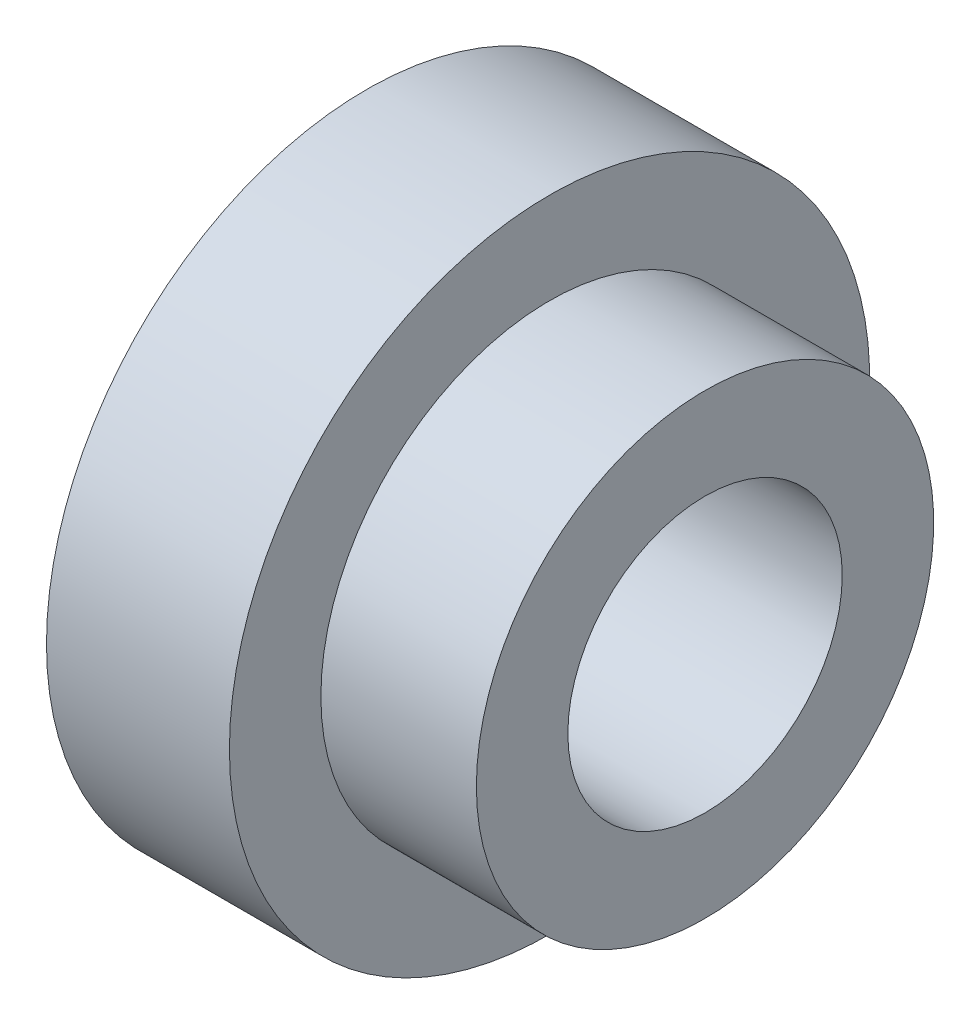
ISO-10303-21;
HEADER;
FILE_DESCRIPTION(('STEP AP214'),'2;1');
FILE_NAME('part.step','',(''),(''),'','','');
FILE_SCHEMA(('AUTOMOTIVE_DESIGN { 1 0 10303 214 1 1 1 1 }'));
ENDSEC;
DATA;
#1=APPLICATION_CONTEXT('core data for automotive mechanical design processes');
#2=APPLICATION_PROTOCOL_DEFINITION('international standard','automotive_design',2000,#1);
#3=PRODUCT_CONTEXT('',#1,'mechanical');
#4=PRODUCT('Part','Part','',(#3));
#5=PRODUCT_RELATED_PRODUCT_CATEGORY('part','',(#4));
#6=PRODUCT_DEFINITION_FORMATION('','',#4);
#7=PRODUCT_DEFINITION_CONTEXT('part definition',#1,'design');
#8=PRODUCT_DEFINITION('design','',#6,#7);
#9=PRODUCT_DEFINITION_SHAPE('','',#8);
#10=(LENGTH_UNIT() NAMED_UNIT(*) SI_UNIT(.MILLI.,.METRE.));
#11=(NAMED_UNIT(*) PLANE_ANGLE_UNIT() SI_UNIT($,.RADIAN.));
#12=(NAMED_UNIT(*) SI_UNIT($,.STERADIAN.) SOLID_ANGLE_UNIT());
#13=UNCERTAINTY_MEASURE_WITH_UNIT(LENGTH_MEASURE(1.E-05),#10,'distance_accuracy_value','');
#14=(GEOMETRIC_REPRESENTATION_CONTEXT(3) GLOBAL_UNCERTAINTY_ASSIGNED_CONTEXT((#13)) GLOBAL_UNIT_ASSIGNED_CONTEXT((#10,
#11,#12)) REPRESENTATION_CONTEXT('',''));
#15=CARTESIAN_POINT('',(0.,0.,0.));
#16=DIRECTION('',(0.,0.,1.));
#17=DIRECTION('',(1.,0.,0.));
#18=AXIS2_PLACEMENT_3D('',#15,#16,#17);
#19=CARTESIAN_POINT('',(0.,0.,-7.));
#20=DIRECTION('',(1.,0.,0.));
#21=DIRECTION('',(0.,0.,-1.));
#22=AXIS2_PLACEMENT_3D('',#19,#20,#21);
#23=PLANE('',#22);
#24=CARTESIAN_POINT('',(0.,0.,0.));
#25=DIRECTION('',(1.,0.,0.));
#26=DIRECTION('',(0.,0.,-1.));
#27=AXIS2_PLACEMENT_3D('',#24,#25,#26);
#28=CIRCLE('',#27,3.);
#29=CARTESIAN_POINT('',(0.,0.,-3.));
#30=VERTEX_POINT('',#29);
#31=EDGE_CURVE('E48',#30,#30,#28,.T.);
#32=ORIENTED_EDGE('',*,*,#31,.T.);
#33=EDGE_LOOP('',(#32));
#34=FACE_BOUND('',#33,.T.);
#35=CARTESIAN_POINT('',(0.,0.,0.));
#36=DIRECTION('',(-1.,0.,0.));
#37=DIRECTION('',(0.,0.,1.));
#38=AXIS2_PLACEMENT_3D('',#35,#36,#37);
#39=CIRCLE('',#38,7.);
#40=CARTESIAN_POINT('',(0.,0.,7.));
#41=VERTEX_POINT('',#40);
#42=EDGE_CURVE('E43',#41,#41,#39,.T.);
#43=ORIENTED_EDGE('',*,*,#42,.T.);
#44=EDGE_LOOP('',(#43));
#45=FACE_BOUND('',#44,.T.);
#46=ADVANCED_FACE('F29',(#34,#45),#23,.F.);
#47=CARTESIAN_POINT('',(7.40000000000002,0.,0.));
#48=DIRECTION('',(-1.,0.,0.));
#49=DIRECTION('',(0.,0.,1.));
#50=AXIS2_PLACEMENT_3D('',#47,#48,#49);
#51=PLANE('',#50);
#52=CARTESIAN_POINT('',(7.40000000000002,0.,0.));
#53=DIRECTION('',(1.,0.,0.));
#54=DIRECTION('',(0.,0.,-1.));
#55=AXIS2_PLACEMENT_3D('',#52,#53,#54);
#56=CIRCLE('',#55,3.);
#57=CARTESIAN_POINT('',(7.40000000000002,0.,-3.));
#58=VERTEX_POINT('',#57);
#59=EDGE_CURVE('E49',#58,#58,#56,.T.);
#60=ORIENTED_EDGE('',*,*,#59,.F.);
#61=EDGE_LOOP('',(#60));
#62=FACE_BOUND('',#61,.T.);
#63=CARTESIAN_POINT('',(7.40000000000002,0.,0.));
#64=DIRECTION('',(-1.,0.,0.));
#65=DIRECTION('',(0.,0.,1.));
#66=AXIS2_PLACEMENT_3D('',#63,#64,#65);
#67=CIRCLE('',#66,5.);
#68=CARTESIAN_POINT('',(7.40000000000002,0.,5.));
#69=VERTEX_POINT('',#68);
#70=EDGE_CURVE('E10',#69,#69,#67,.T.);
#71=ORIENTED_EDGE('',*,*,#70,.F.);
#72=EDGE_LOOP('',(#71));
#73=FACE_BOUND('',#72,.T.);
#74=ADVANCED_FACE('F64',(#62,#73),#51,.F.);
#75=CARTESIAN_POINT('',(0.,0.,0.));
#76=DIRECTION('',(-1.,0.,0.));
#77=DIRECTION('',(0.,0.,1.));
#78=AXIS2_PLACEMENT_3D('',#75,#76,#77);
#79=CYLINDRICAL_SURFACE('',#78,5.);
#80=CARTESIAN_POINT('',(4.00000000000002,0.,0.));
#81=DIRECTION('',(-1.,0.,0.));
#82=DIRECTION('',(0.,0.,1.));
#83=AXIS2_PLACEMENT_3D('',#80,#81,#82);
#84=CIRCLE('',#83,5.);
#85=CARTESIAN_POINT('',(4.00000000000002,0.,5.));
#86=VERTEX_POINT('',#85);
#87=EDGE_CURVE('E35',#86,#86,#84,.T.);
#88=ORIENTED_EDGE('',*,*,#87,.F.);
#89=EDGE_LOOP('',(#88));
#90=FACE_BOUND('',#89,.T.);
#91=ORIENTED_EDGE('',*,*,#70,.T.);
#92=EDGE_LOOP('',(#91));
#93=FACE_BOUND('',#92,.T.);
#94=ADVANCED_FACE('F67',(#90,#93),#79,.T.);
#95=CARTESIAN_POINT('',(4.00000000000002,0.,-5.));
#96=DIRECTION('',(-1.,0.,0.));
#97=DIRECTION('',(0.,0.,1.));
#98=AXIS2_PLACEMENT_3D('',#95,#96,#97);
#99=PLANE('',#98);
#100=CARTESIAN_POINT('',(4.00000000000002,0.,0.));
#101=DIRECTION('',(-1.,0.,0.));
#102=DIRECTION('',(0.,0.,1.));
#103=AXIS2_PLACEMENT_3D('',#100,#101,#102);
#104=CIRCLE('',#103,7.);
#105=CARTESIAN_POINT('',(4.00000000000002,0.,7.));
#106=VERTEX_POINT('',#105);
#107=EDGE_CURVE('E39',#106,#106,#104,.T.);
#108=ORIENTED_EDGE('',*,*,#107,.F.);
#109=EDGE_LOOP('',(#108));
#110=FACE_BOUND('',#109,.T.);
#111=ORIENTED_EDGE('',*,*,#87,.T.);
#112=EDGE_LOOP('',(#111));
#113=FACE_BOUND('',#112,.T.);
#114=ADVANCED_FACE('F72',(#110,#113),#99,.F.);
#115=CARTESIAN_POINT('',(0.,0.,0.));
#116=DIRECTION('',(-1.,0.,0.));
#117=DIRECTION('',(0.,0.,1.));
#118=AXIS2_PLACEMENT_3D('',#115,#116,#117);
#119=CYLINDRICAL_SURFACE('',#118,7.);
#120=ORIENTED_EDGE('',*,*,#42,.F.);
#121=EDGE_LOOP('',(#120));
#122=FACE_BOUND('',#121,.T.);
#123=ORIENTED_EDGE('',*,*,#107,.T.);
#124=EDGE_LOOP('',(#123));
#125=FACE_BOUND('',#124,.T.);
#126=ADVANCED_FACE('F60',(#122,#125),#119,.T.);
#127=CARTESIAN_POINT('',(0.,0.,0.));
#128=DIRECTION('',(1.,0.,0.));
#129=DIRECTION('',(0.,0.,-1.));
#130=AXIS2_PLACEMENT_3D('',#127,#128,#129);
#131=CYLINDRICAL_SURFACE('',#130,3.);
#132=ORIENTED_EDGE('',*,*,#31,.F.);
#133=EDGE_LOOP('',(#132));
#134=FACE_BOUND('',#133,.T.);
#135=ORIENTED_EDGE('',*,*,#59,.T.);
#136=EDGE_LOOP('',(#135));
#137=FACE_BOUND('',#136,.T.);
#138=ADVANCED_FACE('F57',(#134,#137),#131,.F.);
#139=CLOSED_SHELL('',(#46,#74,#94,#114,#126,#138));
#140=MANIFOLD_SOLID_BREP('B2',#139);
#141=ADVANCED_BREP_SHAPE_REPRESENTATION('',(#18,#140),#14);
#142=SHAPE_DEFINITION_REPRESENTATION(#9,#141);
ENDSEC;
END-ISO-10303-21;
